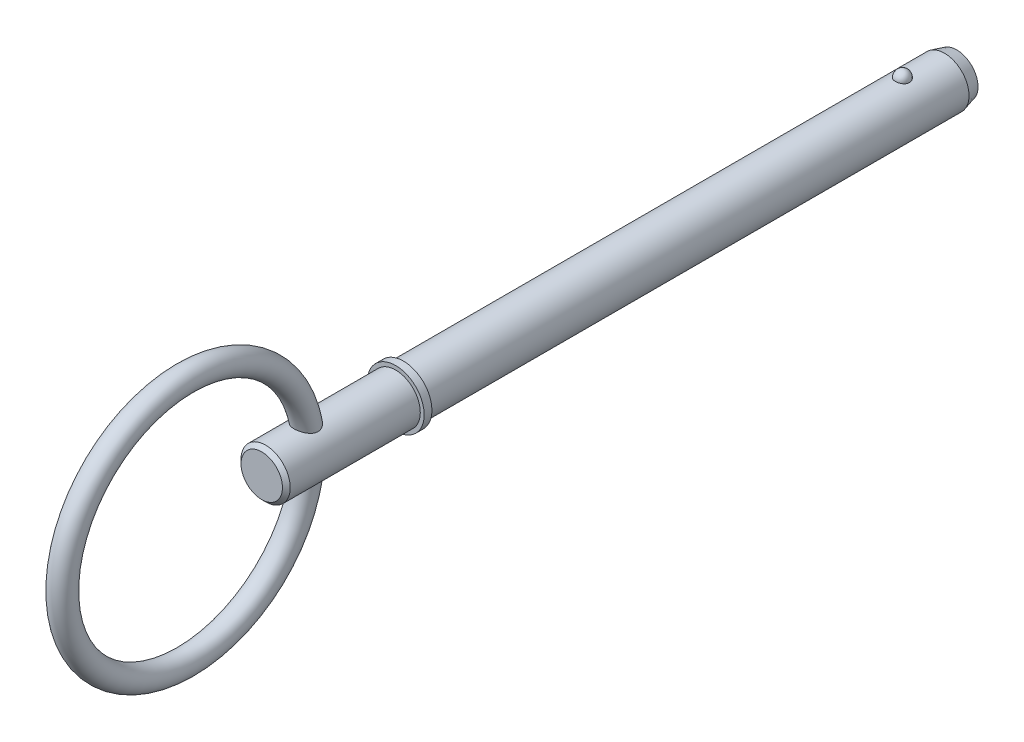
from build123d import *

# Parameters (mm, degrees)
SKETCH2_R           = 3.175
BOSS_EXTRUDE1_DEPTH = 63.5
BOSS_EXTRUDE2_START = 7.92
SKETCH3_R           = 3.175
BOSS_EXTRUDE2_DEPTH = 7.92
CHAMFER1_SIZE       = 1.586
CHAMFER1_SIZE2      = 0.424967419
SKETCH20_W          = 1
SKETCH20_H          = 3.675
SKETCH21_R          = 3.175
BOSS_EXTRUDE3_DEPTH = 18.29
CHAMFER2_SIZE       = 0.5
SKETCH24_R          = 1.5


with BuildPart() as part:
    # Sketch2 → Boss-Extrude1 (new body)
    with BuildSketch(Plane.XY):
        Circle(SKETCH2_R)
    extrude(amount=BOSS_EXTRUDE1_DEPTH)

    # Sketch3 → Boss-Extrude2 (add)
    with BuildSketch(Plane(origin=(0, 0, 0), x_dir=(-1, 0, 0), z_dir=(0, 0, -1)).offset(BOSS_EXTRUDE2_START)):
        Circle(SKETCH3_R)
    extrude(amount=-BOSS_EXTRUDE2_DEPTH)

    # Chamfer1
    chamfer1_edges = [part.edges().sort_by_distance(p)[0] for p in [
        (3.175, 0, -7.92),
    ]]
    chamfer1_side = [part.faces().sort_by_distance(p)[0] for p in [
        (3.175, 0, -3.96),
    ]]
    chamfer(chamfer1_edges, length=CHAMFER1_SIZE, length2=CHAMFER1_SIZE2, reference=chamfer1_side[0])

    # Sketch18 → Revolve1 (revolve)
    with BuildSketch(Plane(origin=(0, 0, 0), x_dir=(0, 0, -1), z_dir=(1, 0, 0))):
        with BuildLine():
            Line((0.91, 4.085), (0.91, 2.265))
            ThreePointArc((0.91, 2.265), (0, 3.175), (0.91, 4.085))
        make_face()
    revolve(axis=Axis((0, 4.085, -0.91), (0, -1, 0)))

    # Sketch20 → Revolve2 (revolve)
    with BuildSketch(Plane(origin=(0, 0, 0), x_dir=(0, 0, -1), z_dir=(1, 0, 0)), mode=Mode.PRIVATE) as revolve2_sk:
        with Locations((-64, 1.8375)):
            Rectangle(SKETCH20_W, SKETCH20_H)
    revolve(revolve2_sk.sketch.rotate(Axis((0, 0, 33.728787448), (0, 0, 1)), 90), axis=Axis((0, 0, 33.728787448), (0, 0, 1)))

    # Sketch21 → Boss-Extrude3 (add)
    with BuildSketch(Plane(origin=(0, 0, 63.5), x_dir=(-1, 0, 0), z_dir=(0, 0, -1))):
        Circle(SKETCH21_R)
    extrude(amount=-BOSS_EXTRUDE3_DEPTH)

    # Chamfer2
    chamfer2_edges = [part.edges().sort_by_distance(p)[0] for p in [
        (3.175, 0, 81.79),
    ]]
    chamfer(chamfer2_edges, length=CHAMFER2_SIZE)

    # Sweep1: sweep along a path in Sketch23
    with BuildLine(Plane(origin=(0, 0, 0), x_dir=(0, 0, -1), z_dir=(1, 0, 0))) as sweep1_path:
        CenterArc((-91.665, 0), 15.875, 0, 360)
    # Sketch24 → Sweep1 (sweep)
    with BuildSketch(Plane(origin=(0, 0, 0), x_dir=(1, 0, 0), z_dir=(0, 1, 0))):
        with Locations((0, -75.79)):
            Circle(SKETCH24_R)
    sweep(path=sweep1_path.line)


solid = part.part
